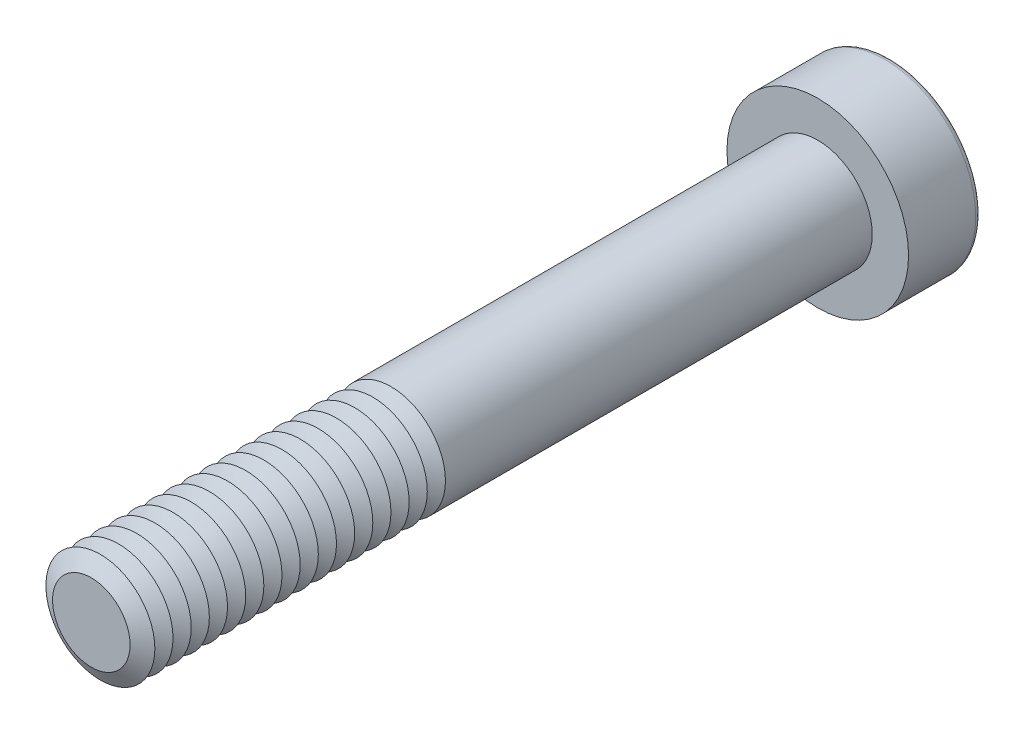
from build123d import *

# Parameters (mm, degrees)
SKETCH1_R           = 3
BOSS_EXTRUDE1_DEPTH = 40
SKETCH2_R           = 5
BOSS_EXTRUDE2_DEPTH = 4
CUT_EXTRUDE1_DEPTH  = 3
FILLET1_R           = 0.3
LPATTERN1_COUNT     = 17
LPATTERN1_PITCH     = 1


with BuildPart() as part:
    # Sketch1 → Boss-Extrude1 (new body)
    with BuildSketch(Plane.XY):
        Circle(SKETCH1_R)
    extrude(amount=BOSS_EXTRUDE1_DEPTH)

    # Sketch2 → Boss-Extrude2 (add)
    with BuildSketch(Plane(origin=(0, 0, 0), x_dir=(-1, 0, 0), z_dir=(0, 0, -1))):
        Circle(SKETCH2_R)
    extrude(amount=BOSS_EXTRUDE2_DEPTH)

    # Sketch3 → Cut-Extrude1 (cut)
    with BuildSketch(Plane(origin=(0, 0, -4), x_dir=(-1, 0, 0), z_dir=(0, 0, -1))):
        Polygon((-1.154700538, 2), (-2.309401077, 0), (-1.154700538, -2), (1.154700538, -2), (2.309401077, 0), (1.154700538, 2), align=None)
    extrude(amount=-CUT_EXTRUDE1_DEPTH, mode=Mode.SUBTRACT)

    # Fillet1
    fillet1_edges = [part.edges().sort_by_distance(p)[0] for p in [
        (5, 0, -4),
    ]]
    fillet(fillet1_edges, radius=FILLET1_R)

    # Cut-Extrude2 cone 1 section (on through the dimple's axis) → Cut-Extrude2 (revolve, cut)
    with BuildSketch(Plane(origin=(0, 0, -1), x_dir=(0, 1, 0), z_dir=(1, 0, 0))):
        Polygon((0, 0), (2, 0), (0, 1.154700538), align=None)
    revolve(axis=Axis((0, 0, -1), (0, 0, 1)), mode=Mode.SUBTRACT)

    # Cut-Extrude3 cone 1 section (on through the dimple's axis) → Cut-Extrude3 (revolve, cut)
    with BuildSketch(Plane(origin=(0, 0, -4), x_dir=(0, 1, 0), z_dir=(1, 0, 0))):
        Polygon((0, 0), (2.309401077, 0), (0, 0.618802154), align=None)
    revolve(axis=Axis((0, 0, -4), (0, 0, 1)), mode=Mode.SUBTRACT)

    # Sketch7 → Cut-Revolve1 (revolve, cut)
    with BuildSketch(Plane(origin=(0, 0, 0), x_dir=(0, 0, -1), z_dir=(1, 0, 0)), mode=Mode.PRIVATE) as cut_revolve1_sk:
        Polygon((-40, 2.133974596), (-39.5, 3), (-40.5, 3), align=None)
    cut_revolve1 = revolve(cut_revolve1_sk.sketch.rotate(Axis((0, 0, 40), (0, 0, -1)), 90), axis=Axis((0, 0, 40), (0, 0, -1)), mode=Mode.SUBTRACT)

    # LPattern1: Cut-Revolve1 ×17
    with Locations(*[(0, 0, -i * LPATTERN1_PITCH) for i in range(1, LPATTERN1_COUNT)]):
        add(cut_revolve1, mode=Mode.SUBTRACT)


solid = part.part
